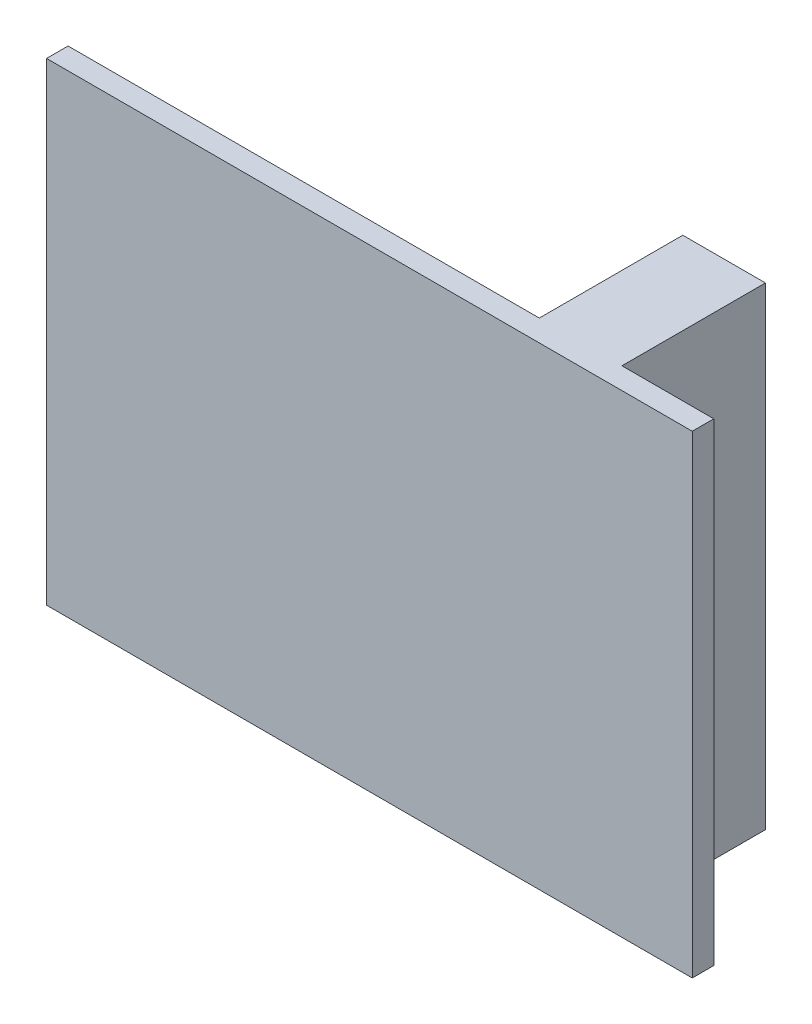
ISO-10303-21;
HEADER;
FILE_DESCRIPTION(('STEP AP214'),'2;1');
FILE_NAME('part.step','',(''),(''),'','','');
FILE_SCHEMA(('AUTOMOTIVE_DESIGN { 1 0 10303 214 1 1 1 1 }'));
ENDSEC;
DATA;
#1=APPLICATION_CONTEXT('core data for automotive mechanical design processes');
#2=APPLICATION_PROTOCOL_DEFINITION('international standard','automotive_design',2000,#1);
#3=PRODUCT_CONTEXT('',#1,'mechanical');
#4=PRODUCT('Part','Part','',(#3));
#5=PRODUCT_RELATED_PRODUCT_CATEGORY('part','',(#4));
#6=PRODUCT_DEFINITION_FORMATION('','',#4);
#7=PRODUCT_DEFINITION_CONTEXT('part definition',#1,'design');
#8=PRODUCT_DEFINITION('design','',#6,#7);
#9=PRODUCT_DEFINITION_SHAPE('','',#8);
#10=(LENGTH_UNIT() NAMED_UNIT(*) SI_UNIT(.MILLI.,.METRE.));
#11=(NAMED_UNIT(*) PLANE_ANGLE_UNIT() SI_UNIT($,.RADIAN.));
#12=(NAMED_UNIT(*) SI_UNIT($,.STERADIAN.) SOLID_ANGLE_UNIT());
#13=UNCERTAINTY_MEASURE_WITH_UNIT(LENGTH_MEASURE(1.E-05),#10,'distance_accuracy_value','');
#14=(GEOMETRIC_REPRESENTATION_CONTEXT(3) GLOBAL_UNCERTAINTY_ASSIGNED_CONTEXT((#13)) GLOBAL_UNIT_ASSIGNED_CONTEXT((#10,
#11,#12)) REPRESENTATION_CONTEXT('',''));
#15=CARTESIAN_POINT('',(0.,0.,0.));
#16=DIRECTION('',(0.,0.,1.));
#17=DIRECTION('',(1.,0.,0.));
#18=AXIS2_PLACEMENT_3D('',#15,#16,#17);
#19=CARTESIAN_POINT('',(0.,0.,0.));
#20=DIRECTION('',(0.,0.,1.));
#21=DIRECTION('',(1.,0.,0.));
#22=AXIS2_PLACEMENT_3D('',#19,#20,#21);
#23=PLANE('',#22);
#24=DIRECTION('',(0.,-1.,0.));
#25=VECTOR('',#24,1.);
#26=CARTESIAN_POINT('',(-14.4980674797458,29.2887596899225,0.));
#27=LINE('',#26,#25);
#28=CARTESIAN_POINT('',(-14.4980674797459,29.2887596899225,0.));
#29=VERTEX_POINT('',#28);
#30=CARTESIAN_POINT('',(-14.4980674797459,-3.71124031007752,0.));
#31=VERTEX_POINT('',#30);
#32=EDGE_CURVE('E121',#29,#31,#27,.T.);
#33=ORIENTED_EDGE('',*,*,#32,.F.);
#34=DIRECTION('',(-1.,0.,0.));
#35=VECTOR('',#34,1.);
#36=CARTESIAN_POINT('',(-53.0980674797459,29.2887596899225,0.));
#37=LINE('',#36,#35);
#38=CARTESIAN_POINT('',(-8.09806747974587,29.2887596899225,0.));
#39=VERTEX_POINT('',#38);
#40=EDGE_CURVE('E159',#39,#29,#37,.T.);
#41=ORIENTED_EDGE('',*,*,#40,.F.);
#42=DIRECTION('',(0.,1.,0.));
#43=VECTOR('',#42,1.);
#44=CARTESIAN_POINT('',(-8.09806747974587,29.2887596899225,0.));
#45=LINE('',#44,#43);
#46=CARTESIAN_POINT('',(-8.09806747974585,-3.71124031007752,0.));
#47=VERTEX_POINT('',#46);
#48=EDGE_CURVE('E167',#47,#39,#45,.T.);
#49=ORIENTED_EDGE('',*,*,#48,.F.);
#50=DIRECTION('',(1.,0.,0.));
#51=VECTOR('',#50,1.);
#52=CARTESIAN_POINT('',(-53.0980674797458,-3.71124031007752,0.));
#53=LINE('',#52,#51);
#54=EDGE_CURVE('E50',#31,#47,#53,.T.);
#55=ORIENTED_EDGE('',*,*,#54,.F.);
#56=EDGE_LOOP('',(#33,#41,#49,#55));
#57=FACE_BOUND('',#56,.T.);
#58=ADVANCED_FACE('F33',(#57),#23,.F.);
#59=DIRECTION('',(0.,1.,0.));
#60=VECTOR('',#59,1.);
#61=CARTESIAN_POINT('',(-20.2580674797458,29.2887596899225,0.));
#62=LINE('',#61,#60);
#63=CARTESIAN_POINT('',(-20.2580674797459,-3.71124031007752,0.));
#64=VERTEX_POINT('',#63);
#65=CARTESIAN_POINT('',(-20.2580674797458,29.2887596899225,0.));
#66=VERTEX_POINT('',#65);
#67=EDGE_CURVE('E58',#64,#66,#62,.T.);
#68=ORIENTED_EDGE('',*,*,#67,.F.);
#69=CARTESIAN_POINT('',(-53.0980674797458,-3.71124031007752,0.));
#70=VERTEX_POINT('',#69);
#71=EDGE_CURVE('E185',#70,#64,#53,.T.);
#72=ORIENTED_EDGE('',*,*,#71,.F.);
#73=DIRECTION('',(0.,-1.,0.));
#74=VECTOR('',#73,1.);
#75=CARTESIAN_POINT('',(-53.0980674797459,29.2887596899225,0.));
#76=LINE('',#75,#74);
#77=CARTESIAN_POINT('',(-53.0980674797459,29.2887596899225,0.));
#78=VERTEX_POINT('',#77);
#79=EDGE_CURVE('E122',#78,#70,#76,.T.);
#80=ORIENTED_EDGE('',*,*,#79,.F.);
#81=EDGE_CURVE('E163',#66,#78,#37,.T.);
#82=ORIENTED_EDGE('',*,*,#81,.F.);
#83=EDGE_LOOP('',(#68,#72,#80,#82));
#84=FACE_BOUND('',#83,.T.);
#85=ADVANCED_FACE('F197',(#84),#23,.F.);
#86=CARTESIAN_POINT('',(-53.0980674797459,29.2887596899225,1.5));
#87=DIRECTION('',(1.,0.,0.));
#88=DIRECTION('',(0.,1.,0.));
#89=AXIS2_PLACEMENT_3D('',#86,#87,#88);
#90=PLANE('',#89);
#91=ORIENTED_EDGE('',*,*,#79,.T.);
#92=DIRECTION('',(0.,0.,-1.));
#93=VECTOR('',#92,1.);
#94=CARTESIAN_POINT('',(-53.0980674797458,-3.71124031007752,1.5));
#95=LINE('',#94,#93);
#96=CARTESIAN_POINT('',(-53.0980674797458,-3.71124031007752,1.5));
#97=VERTEX_POINT('',#96);
#98=EDGE_CURVE('E11',#97,#70,#95,.T.);
#99=ORIENTED_EDGE('',*,*,#98,.F.);
#100=DIRECTION('',(0.,-1.,0.));
#101=VECTOR('',#100,1.);
#102=CARTESIAN_POINT('',(-53.0980674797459,29.2887596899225,1.5));
#103=LINE('',#102,#101);
#104=CARTESIAN_POINT('',(-53.0980674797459,29.2887596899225,1.5));
#105=VERTEX_POINT('',#104);
#106=EDGE_CURVE('E141',#105,#97,#103,.T.);
#107=ORIENTED_EDGE('',*,*,#106,.F.);
#108=DIRECTION('',(0.,0.,-1.));
#109=VECTOR('',#108,1.);
#110=CARTESIAN_POINT('',(-53.0980674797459,29.2887596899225,1.5));
#111=LINE('',#110,#109);
#112=EDGE_CURVE('E174',#105,#78,#111,.T.);
#113=ORIENTED_EDGE('',*,*,#112,.T.);
#114=EDGE_LOOP('',(#91,#99,#107,#113));
#115=FACE_BOUND('',#114,.T.);
#116=ADVANCED_FACE('F35',(#115),#90,.F.);
#117=CARTESIAN_POINT('',(-53.0980674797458,-3.71124031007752,1.5));
#118=DIRECTION('',(0.,1.,0.));
#119=DIRECTION('',(0.,0.,1.));
#120=AXIS2_PLACEMENT_3D('',#117,#118,#119);
#121=PLANE('',#120);
#122=ORIENTED_EDGE('',*,*,#71,.T.);
#123=DIRECTION('',(0.,0.,1.));
#124=VECTOR('',#123,1.);
#125=CARTESIAN_POINT('',(-20.2580674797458,-3.71124031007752,-10.));
#126=LINE('',#125,#124);
#127=CARTESIAN_POINT('',(-20.2580674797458,-3.71124031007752,-10.));
#128=VERTEX_POINT('',#127);
#129=EDGE_CURVE('E106',#128,#64,#126,.T.);
#130=ORIENTED_EDGE('',*,*,#129,.F.);
#131=DIRECTION('',(-1.,0.,0.));
#132=VECTOR('',#131,1.);
#133=CARTESIAN_POINT('',(-14.4980674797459,-3.71124031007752,-10.));
#134=LINE('',#133,#132);
#135=CARTESIAN_POINT('',(-14.4980674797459,-3.71124031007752,-10.));
#136=VERTEX_POINT('',#135);
#137=EDGE_CURVE('E99',#136,#128,#134,.T.);
#138=ORIENTED_EDGE('',*,*,#137,.F.);
#139=DIRECTION('',(0.,0.,1.));
#140=VECTOR('',#139,1.);
#141=CARTESIAN_POINT('',(-14.4980674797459,-3.71124031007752,-10.));
#142=LINE('',#141,#140);
#143=EDGE_CURVE('E103',#136,#31,#142,.T.);
#144=ORIENTED_EDGE('',*,*,#143,.T.);
#145=ORIENTED_EDGE('',*,*,#54,.T.);
#146=DIRECTION('',(0.,0.,-1.));
#147=VECTOR('',#146,1.);
#148=CARTESIAN_POINT('',(-8.09806747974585,-3.71124031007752,1.5));
#149=LINE('',#148,#147);
#150=CARTESIAN_POINT('',(-8.09806747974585,-3.71124031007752,1.5));
#151=VERTEX_POINT('',#150);
#152=EDGE_CURVE('E42',#151,#47,#149,.T.);
#153=ORIENTED_EDGE('',*,*,#152,.F.);
#154=DIRECTION('',(1.,0.,0.));
#155=VECTOR('',#154,1.);
#156=CARTESIAN_POINT('',(-53.0980674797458,-3.71124031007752,1.5));
#157=LINE('',#156,#155);
#158=EDGE_CURVE('E166',#97,#151,#157,.T.);
#159=ORIENTED_EDGE('',*,*,#158,.F.);
#160=ORIENTED_EDGE('',*,*,#98,.T.);
#161=EDGE_LOOP('',(#122,#130,#138,#144,#145,#153,#159,#160));
#162=FACE_BOUND('',#161,.T.);
#163=ADVANCED_FACE('F101',(#162),#121,.F.);
#164=CARTESIAN_POINT('',(-8.09806747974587,29.2887596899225,1.5));
#165=DIRECTION('',(-1.,0.,0.));
#166=DIRECTION('',(0.,-1.,0.));
#167=AXIS2_PLACEMENT_3D('',#164,#165,#166);
#168=PLANE('',#167);
#169=ORIENTED_EDGE('',*,*,#48,.T.);
#170=DIRECTION('',(0.,0.,-1.));
#171=VECTOR('',#170,1.);
#172=CARTESIAN_POINT('',(-8.09806747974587,29.2887596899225,1.5));
#173=LINE('',#172,#171);
#174=CARTESIAN_POINT('',(-8.09806747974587,29.2887596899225,1.5));
#175=VERTEX_POINT('',#174);
#176=EDGE_CURVE('E162',#175,#39,#173,.T.);
#177=ORIENTED_EDGE('',*,*,#176,.F.);
#178=DIRECTION('',(0.,1.,0.));
#179=VECTOR('',#178,1.);
#180=CARTESIAN_POINT('',(-8.09806747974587,29.2887596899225,1.5));
#181=LINE('',#180,#179);
#182=EDGE_CURVE('E184',#151,#175,#181,.T.);
#183=ORIENTED_EDGE('',*,*,#182,.F.);
#184=ORIENTED_EDGE('',*,*,#152,.T.);
#185=EDGE_LOOP('',(#169,#177,#183,#184));
#186=FACE_BOUND('',#185,.T.);
#187=ADVANCED_FACE('F183',(#186),#168,.F.);
#188=CARTESIAN_POINT('',(-53.0980674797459,29.2887596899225,1.5));
#189=DIRECTION('',(0.,-1.,0.));
#190=DIRECTION('',(0.,0.,-1.));
#191=AXIS2_PLACEMENT_3D('',#188,#189,#190);
#192=PLANE('',#191);
#193=ORIENTED_EDGE('',*,*,#40,.T.);
#194=DIRECTION('',(0.,0.,1.));
#195=VECTOR('',#194,1.);
#196=CARTESIAN_POINT('',(-14.4980674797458,29.2887596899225,-10.));
#197=LINE('',#196,#195);
#198=CARTESIAN_POINT('',(-14.4980674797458,29.2887596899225,-10.));
#199=VERTEX_POINT('',#198);
#200=EDGE_CURVE('E134',#199,#29,#197,.T.);
#201=ORIENTED_EDGE('',*,*,#200,.F.);
#202=DIRECTION('',(1.,0.,0.));
#203=VECTOR('',#202,1.);
#204=CARTESIAN_POINT('',(-14.4980674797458,29.2887596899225,-10.));
#205=LINE('',#204,#203);
#206=CARTESIAN_POINT('',(-20.2580674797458,29.2887596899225,-10.));
#207=VERTEX_POINT('',#206);
#208=EDGE_CURVE('E115',#207,#199,#205,.T.);
#209=ORIENTED_EDGE('',*,*,#208,.F.);
#210=DIRECTION('',(0.,0.,1.));
#211=VECTOR('',#210,1.);
#212=CARTESIAN_POINT('',(-20.2580674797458,29.2887596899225,-10.));
#213=LINE('',#212,#211);
#214=EDGE_CURVE('E126',#207,#66,#213,.T.);
#215=ORIENTED_EDGE('',*,*,#214,.T.);
#216=ORIENTED_EDGE('',*,*,#81,.T.);
#217=ORIENTED_EDGE('',*,*,#112,.F.);
#218=DIRECTION('',(-1.,0.,0.));
#219=VECTOR('',#218,1.);
#220=CARTESIAN_POINT('',(-53.0980674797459,29.2887596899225,1.5));
#221=LINE('',#220,#219);
#222=EDGE_CURVE('E178',#175,#105,#221,.T.);
#223=ORIENTED_EDGE('',*,*,#222,.F.);
#224=ORIENTED_EDGE('',*,*,#176,.T.);
#225=EDGE_LOOP('',(#193,#201,#209,#215,#216,#217,#223,#224));
#226=FACE_BOUND('',#225,.T.);
#227=ADVANCED_FACE('F156',(#226),#192,.F.);
#228=CARTESIAN_POINT('',(0.,0.,1.5));
#229=DIRECTION('',(0.,0.,1.));
#230=DIRECTION('',(1.,0.,0.));
#231=AXIS2_PLACEMENT_3D('',#228,#229,#230);
#232=PLANE('',#231);
#233=ORIENTED_EDGE('',*,*,#106,.T.);
#234=ORIENTED_EDGE('',*,*,#158,.T.);
#235=ORIENTED_EDGE('',*,*,#182,.T.);
#236=ORIENTED_EDGE('',*,*,#222,.T.);
#237=EDGE_LOOP('',(#233,#234,#235,#236));
#238=FACE_BOUND('',#237,.T.);
#239=ADVANCED_FACE('F191',(#238),#232,.T.);
#240=CARTESIAN_POINT('',(-14.4980674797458,29.2887596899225,-10.));
#241=DIRECTION('',(-1.,0.,0.));
#242=DIRECTION('',(0.,-1.,0.));
#243=AXIS2_PLACEMENT_3D('',#240,#241,#242);
#244=PLANE('',#243);
#245=ORIENTED_EDGE('',*,*,#32,.T.);
#246=ORIENTED_EDGE('',*,*,#143,.F.);
#247=DIRECTION('',(0.,-1.,0.));
#248=VECTOR('',#247,1.);
#249=CARTESIAN_POINT('',(-14.4980674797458,29.2887596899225,-10.));
#250=LINE('',#249,#248);
#251=EDGE_CURVE('E110',#199,#136,#250,.T.);
#252=ORIENTED_EDGE('',*,*,#251,.F.);
#253=ORIENTED_EDGE('',*,*,#200,.T.);
#254=EDGE_LOOP('',(#245,#246,#252,#253));
#255=FACE_BOUND('',#254,.T.);
#256=ADVANCED_FACE('F120',(#255),#244,.F.);
#257=CARTESIAN_POINT('',(-20.2580674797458,29.2887596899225,-10.));
#258=DIRECTION('',(1.,0.,0.));
#259=DIRECTION('',(0.,1.,0.));
#260=AXIS2_PLACEMENT_3D('',#257,#258,#259);
#261=PLANE('',#260);
#262=ORIENTED_EDGE('',*,*,#67,.T.);
#263=ORIENTED_EDGE('',*,*,#214,.F.);
#264=DIRECTION('',(0.,1.,0.));
#265=VECTOR('',#264,1.);
#266=CARTESIAN_POINT('',(-20.2580674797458,29.2887596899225,-10.));
#267=LINE('',#266,#265);
#268=EDGE_CURVE('E109',#128,#207,#267,.T.);
#269=ORIENTED_EDGE('',*,*,#268,.F.);
#270=ORIENTED_EDGE('',*,*,#129,.T.);
#271=EDGE_LOOP('',(#262,#263,#269,#270));
#272=FACE_BOUND('',#271,.T.);
#273=ADVANCED_FACE('F154',(#272),#261,.F.);
#274=CARTESIAN_POINT('',(0.,0.,-10.));
#275=DIRECTION('',(0.,0.,-1.));
#276=DIRECTION('',(-1.,0.,0.));
#277=AXIS2_PLACEMENT_3D('',#274,#275,#276);
#278=PLANE('',#277);
#279=ORIENTED_EDGE('',*,*,#251,.T.);
#280=ORIENTED_EDGE('',*,*,#137,.T.);
#281=ORIENTED_EDGE('',*,*,#268,.T.);
#282=ORIENTED_EDGE('',*,*,#208,.T.);
#283=EDGE_LOOP('',(#279,#280,#281,#282));
#284=FACE_BOUND('',#283,.T.);
#285=ADVANCED_FACE('F113',(#284),#278,.T.);
#286=CLOSED_SHELL('',(#58,#85,#116,#163,#187,#227,#239,#256,#273,#285));
#287=MANIFOLD_SOLID_BREP('B2',#286);
#288=ADVANCED_BREP_SHAPE_REPRESENTATION('',(#18,#287),#14);
#289=SHAPE_DEFINITION_REPRESENTATION(#9,#288);
ENDSEC;
END-ISO-10303-21;
